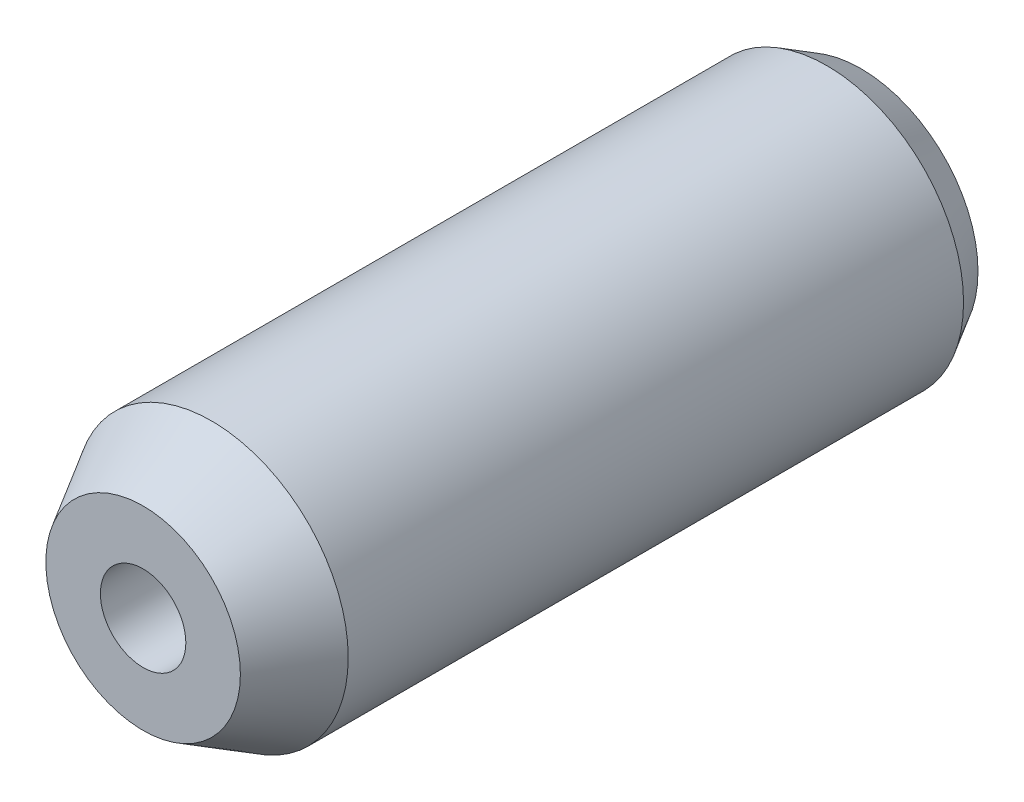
ISO-10303-21;
HEADER;
FILE_DESCRIPTION(('STEP AP214'),'2;1');
FILE_NAME('part.step','',(''),(''),'','','');
FILE_SCHEMA(('AUTOMOTIVE_DESIGN { 1 0 10303 214 1 1 1 1 }'));
ENDSEC;
DATA;
#1=APPLICATION_CONTEXT('core data for automotive mechanical design processes');
#2=APPLICATION_PROTOCOL_DEFINITION('international standard','automotive_design',2000,#1);
#3=PRODUCT_CONTEXT('',#1,'mechanical');
#4=PRODUCT('Part','Part','',(#3));
#5=PRODUCT_RELATED_PRODUCT_CATEGORY('part','',(#4));
#6=PRODUCT_DEFINITION_FORMATION('','',#4);
#7=PRODUCT_DEFINITION_CONTEXT('part definition',#1,'design');
#8=PRODUCT_DEFINITION('design','',#6,#7);
#9=PRODUCT_DEFINITION_SHAPE('','',#8);
#10=(LENGTH_UNIT() NAMED_UNIT(*) SI_UNIT(.MILLI.,.METRE.));
#11=(NAMED_UNIT(*) PLANE_ANGLE_UNIT() SI_UNIT($,.RADIAN.));
#12=(NAMED_UNIT(*) SI_UNIT($,.STERADIAN.) SOLID_ANGLE_UNIT());
#13=UNCERTAINTY_MEASURE_WITH_UNIT(LENGTH_MEASURE(1.E-05),#10,'distance_accuracy_value','');
#14=(GEOMETRIC_REPRESENTATION_CONTEXT(3) GLOBAL_UNCERTAINTY_ASSIGNED_CONTEXT((#13)) GLOBAL_UNIT_ASSIGNED_CONTEXT((#10,
#11,#12)) REPRESENTATION_CONTEXT('',''));
#15=CARTESIAN_POINT('',(0.,0.,0.));
#16=DIRECTION('',(0.,0.,1.));
#17=DIRECTION('',(1.,0.,0.));
#18=AXIS2_PLACEMENT_3D('',#15,#16,#17);
#19=CARTESIAN_POINT('',(0.,0.,0.));
#20=DIRECTION('',(0.,0.,1.));
#21=DIRECTION('',(1.,0.,0.));
#22=AXIS2_PLACEMENT_3D('',#19,#20,#21);
#23=PLANE('',#22);
#24=CARTESIAN_POINT('',(0.,0.,0.));
#25=DIRECTION('',(0.,0.,1.));
#26=DIRECTION('',(1.,0.,0.));
#27=AXIS2_PLACEMENT_3D('',#24,#25,#26);
#28=CIRCLE('',#27,6.84529946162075);
#29=CARTESIAN_POINT('',(6.84529946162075,0.,0.));
#30=VERTEX_POINT('',#29);
#31=EDGE_CURVE('E8',#30,#30,#28,.T.);
#32=ORIENTED_EDGE('',*,*,#31,.F.);
#33=EDGE_LOOP('',(#32));
#34=FACE_BOUND('',#33,.T.);
#35=ADVANCED_FACE('F13',(#34),#23,.F.);
#36=CARTESIAN_POINT('',(0.,0.,2.));
#37=DIRECTION('',(0.,0.,1.));
#38=DIRECTION('',(1.,0.,0.));
#39=AXIS2_PLACEMENT_3D('',#36,#37,#38);
#40=CONICAL_SURFACE('',#39,8.,0.523598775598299);
#41=ORIENTED_EDGE('',*,*,#31,.T.);
#42=EDGE_LOOP('',(#41));
#43=FACE_BOUND('',#42,.T.);
#44=CARTESIAN_POINT('',(0.,0.,2.));
#45=DIRECTION('',(0.,0.,1.));
#46=DIRECTION('',(1.,0.,0.));
#47=AXIS2_PLACEMENT_3D('',#44,#45,#46);
#48=CIRCLE('',#47,8.);
#49=CARTESIAN_POINT('',(8.,0.,2.));
#50=VERTEX_POINT('',#49);
#51=EDGE_CURVE('E19',#50,#50,#48,.T.);
#52=ORIENTED_EDGE('',*,*,#51,.F.);
#53=EDGE_LOOP('',(#52));
#54=FACE_BOUND('',#53,.T.);
#55=ADVANCED_FACE('F61',(#43,#54),#40,.T.);
#56=CARTESIAN_POINT('',(0.,0.,50.));
#57=DIRECTION('',(0.,0.,1.));
#58=DIRECTION('',(1.,0.,0.));
#59=AXIS2_PLACEMENT_3D('',#56,#57,#58);
#60=CYLINDRICAL_SURFACE('',#59,8.);
#61=CARTESIAN_POINT('',(0.,0.,38.));
#62=DIRECTION('',(0.,0.,1.));
#63=DIRECTION('',(1.,0.,0.));
#64=AXIS2_PLACEMENT_3D('',#61,#62,#63);
#65=CIRCLE('',#64,8.);
#66=CARTESIAN_POINT('',(8.,0.,38.));
#67=VERTEX_POINT('',#66);
#68=EDGE_CURVE('E23',#67,#67,#65,.T.);
#69=ORIENTED_EDGE('',*,*,#68,.F.);
#70=EDGE_LOOP('',(#69));
#71=FACE_BOUND('',#70,.T.);
#72=ORIENTED_EDGE('',*,*,#51,.T.);
#73=EDGE_LOOP('',(#72));
#74=FACE_BOUND('',#73,.T.);
#75=ADVANCED_FACE('F56',(#71,#74),#60,.T.);
#76=CARTESIAN_POINT('',(0.,0.,38.));
#77=DIRECTION('',(0.,0.,-1.));
#78=DIRECTION('',(-1.,0.,0.));
#79=AXIS2_PLACEMENT_3D('',#76,#77,#78);
#80=CONICAL_SURFACE('',#79,8.,0.523598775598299);
#81=CARTESIAN_POINT('',(0.,0.,42.));
#82=DIRECTION('',(0.,0.,1.));
#83=DIRECTION('',(1.,0.,0.));
#84=AXIS2_PLACEMENT_3D('',#81,#82,#83);
#85=CIRCLE('',#84,5.69059892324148);
#86=CARTESIAN_POINT('',(5.69059892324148,0.,42.));
#87=VERTEX_POINT('',#86);
#88=EDGE_CURVE('E27',#87,#87,#85,.T.);
#89=ORIENTED_EDGE('',*,*,#88,.F.);
#90=EDGE_LOOP('',(#89));
#91=FACE_BOUND('',#90,.T.);
#92=ORIENTED_EDGE('',*,*,#68,.T.);
#93=EDGE_LOOP('',(#92));
#94=FACE_BOUND('',#93,.T.);
#95=ADVANCED_FACE('F50',(#91,#94),#80,.T.);
#96=CARTESIAN_POINT('',(5.69059892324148,0.,42.));
#97=DIRECTION('',(0.,0.,-1.));
#98=DIRECTION('',(-1.,0.,0.));
#99=AXIS2_PLACEMENT_3D('',#96,#97,#98);
#100=PLANE('',#99);
#101=CARTESIAN_POINT('',(0.,0.,42.));
#102=DIRECTION('',(0.,0.,1.));
#103=DIRECTION('',(1.,0.,0.));
#104=AXIS2_PLACEMENT_3D('',#101,#102,#103);
#105=CIRCLE('',#104,2.5);
#106=CARTESIAN_POINT('',(2.5,0.,42.));
#107=VERTEX_POINT('',#106);
#108=EDGE_CURVE('E32',#107,#107,#105,.T.);
#109=ORIENTED_EDGE('',*,*,#108,.F.);
#110=EDGE_LOOP('',(#109));
#111=FACE_BOUND('',#110,.T.);
#112=ORIENTED_EDGE('',*,*,#88,.T.);
#113=EDGE_LOOP('',(#112));
#114=FACE_BOUND('',#113,.T.);
#115=ADVANCED_FACE('F44',(#111,#114),#100,.F.);
#116=CARTESIAN_POINT('',(0.,0.,50.));
#117=DIRECTION('',(0.,0.,1.));
#118=DIRECTION('',(1.,0.,0.));
#119=AXIS2_PLACEMENT_3D('',#116,#117,#118);
#120=CYLINDRICAL_SURFACE('',#119,2.5);
#121=CARTESIAN_POINT('',(0.,0.,32.));
#122=DIRECTION('',(0.,0.,1.));
#123=DIRECTION('',(1.,0.,0.));
#124=AXIS2_PLACEMENT_3D('',#121,#122,#123);
#125=CIRCLE('',#124,2.5);
#126=CARTESIAN_POINT('',(2.5,0.,32.));
#127=VERTEX_POINT('',#126);
#128=EDGE_CURVE('E35',#127,#127,#125,.T.);
#129=ORIENTED_EDGE('',*,*,#128,.F.);
#130=EDGE_LOOP('',(#129));
#131=FACE_BOUND('',#130,.T.);
#132=ORIENTED_EDGE('',*,*,#108,.T.);
#133=EDGE_LOOP('',(#132));
#134=FACE_BOUND('',#133,.T.);
#135=ADVANCED_FACE('F41',(#131,#134),#120,.F.);
#136=CARTESIAN_POINT('',(0.,0.,32.));
#137=DIRECTION('',(0.,0.,1.));
#138=DIRECTION('',(1.,0.,0.));
#139=AXIS2_PLACEMENT_3D('',#136,#137,#138);
#140=PLANE('',#139);
#141=ORIENTED_EDGE('',*,*,#128,.T.);
#142=EDGE_LOOP('',(#141));
#143=FACE_BOUND('',#142,.T.);
#144=ADVANCED_FACE('F39',(#143),#140,.T.);
#145=CLOSED_SHELL('',(#35,#55,#75,#95,#115,#135,#144));
#146=MANIFOLD_SOLID_BREP('B1',#145);
#147=ADVANCED_BREP_SHAPE_REPRESENTATION('',(#18,#146),#14);
#148=SHAPE_DEFINITION_REPRESENTATION(#9,#147);
ENDSEC;
END-ISO-10303-21;
